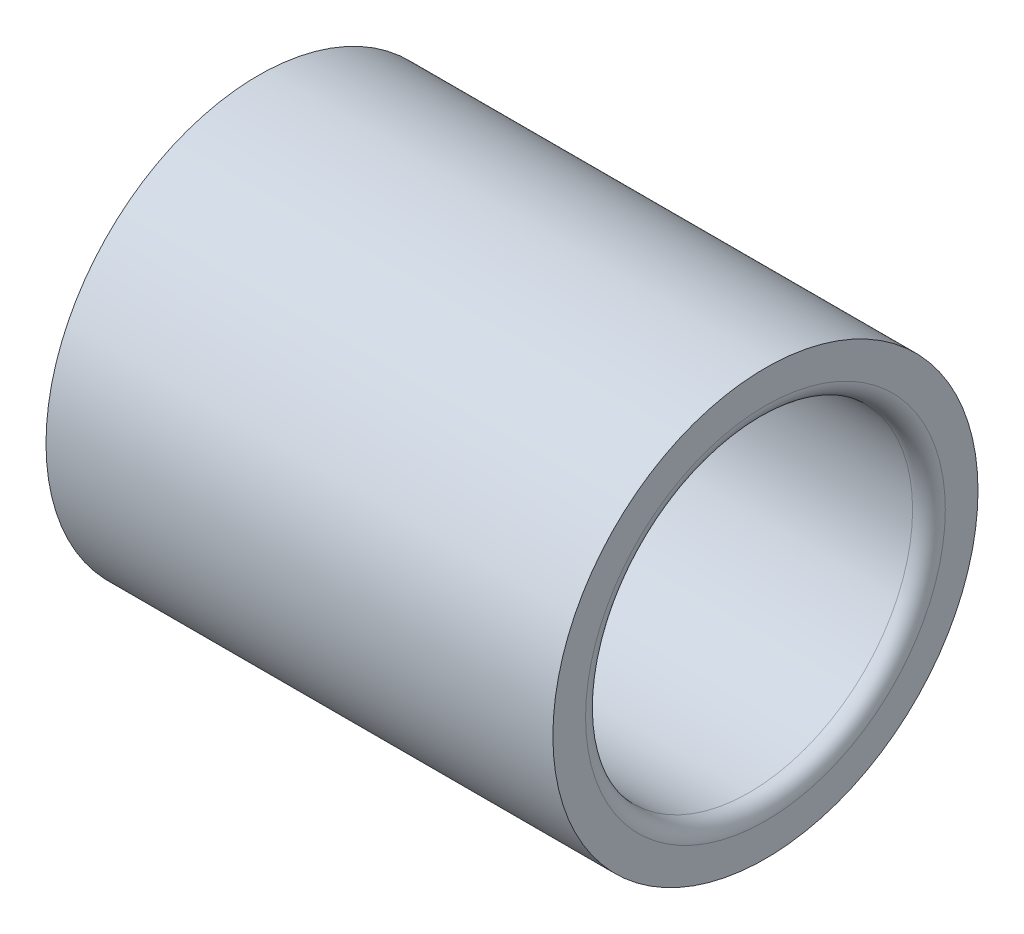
ISO-10303-21;
HEADER;
FILE_DESCRIPTION(('STEP AP214'),'2;1');
FILE_NAME('part.step','',(''),(''),'','','');
FILE_SCHEMA(('AUTOMOTIVE_DESIGN { 1 0 10303 214 1 1 1 1 }'));
ENDSEC;
DATA;
#1=APPLICATION_CONTEXT('core data for automotive mechanical design processes');
#2=APPLICATION_PROTOCOL_DEFINITION('international standard','automotive_design',2000,#1);
#3=PRODUCT_CONTEXT('',#1,'mechanical');
#4=PRODUCT('Part','Part','',(#3));
#5=PRODUCT_RELATED_PRODUCT_CATEGORY('part','',(#4));
#6=PRODUCT_DEFINITION_FORMATION('','',#4);
#7=PRODUCT_DEFINITION_CONTEXT('part definition',#1,'design');
#8=PRODUCT_DEFINITION('design','',#6,#7);
#9=PRODUCT_DEFINITION_SHAPE('','',#8);
#10=(LENGTH_UNIT() NAMED_UNIT(*) SI_UNIT(.MILLI.,.METRE.));
#11=(NAMED_UNIT(*) PLANE_ANGLE_UNIT() SI_UNIT($,.RADIAN.));
#12=(NAMED_UNIT(*) SI_UNIT($,.STERADIAN.) SOLID_ANGLE_UNIT());
#13=UNCERTAINTY_MEASURE_WITH_UNIT(LENGTH_MEASURE(1.E-05),#10,'distance_accuracy_value','');
#14=(GEOMETRIC_REPRESENTATION_CONTEXT(3) GLOBAL_UNCERTAINTY_ASSIGNED_CONTEXT((#13)) GLOBAL_UNIT_ASSIGNED_CONTEXT((#10,
#11,#12)) REPRESENTATION_CONTEXT('',''));
#15=CARTESIAN_POINT('',(0.,0.,0.));
#16=DIRECTION('',(0.,0.,1.));
#17=DIRECTION('',(1.,0.,0.));
#18=AXIS2_PLACEMENT_3D('',#15,#16,#17);
#19=CARTESIAN_POINT('',(0.,11.,0.));
#20=DIRECTION('',(-1.,0.,0.));
#21=DIRECTION('',(0.,0.,1.));
#22=AXIS2_PLACEMENT_3D('',#19,#20,#21);
#23=PLANE('',#22);
#24=CARTESIAN_POINT('',(0.,0.,0.));
#25=DIRECTION('',(-1.,0.,0.));
#26=DIRECTION('',(0.,0.,1.));
#27=AXIS2_PLACEMENT_3D('',#24,#25,#26);
#28=CIRCLE('',#27,13.);
#29=CARTESIAN_POINT('',(0.,0.,13.));
#30=VERTEX_POINT('',#29);
#31=EDGE_CURVE('E10',#30,#30,#28,.T.);
#32=ORIENTED_EDGE('',*,*,#31,.T.);
#33=EDGE_LOOP('',(#32));
#34=FACE_BOUND('',#33,.T.);
#35=CARTESIAN_POINT('',(0.,0.,0.));
#36=DIRECTION('',(-1.,0.,0.));
#37=DIRECTION('',(0.,0.,1.));
#38=AXIS2_PLACEMENT_3D('',#35,#36,#37);
#39=CIRCLE('',#38,11.);
#40=CARTESIAN_POINT('',(0.,0.,11.));
#41=VERTEX_POINT('',#40);
#42=EDGE_CURVE('E37',#41,#41,#39,.T.);
#43=ORIENTED_EDGE('',*,*,#42,.F.);
#44=EDGE_LOOP('',(#43));
#45=FACE_BOUND('',#44,.T.);
#46=ADVANCED_FACE('F15',(#34,#45),#23,.T.);
#47=CARTESIAN_POINT('',(0.,0.,0.));
#48=DIRECTION('',(-1.,0.,0.));
#49=DIRECTION('',(0.,0.,1.));
#50=AXIS2_PLACEMENT_3D('',#47,#48,#49);
#51=CYLINDRICAL_SURFACE('',#50,13.);
#52=CARTESIAN_POINT('',(31.,0.,0.));
#53=DIRECTION('',(-1.,0.,0.));
#54=DIRECTION('',(0.,0.,1.));
#55=AXIS2_PLACEMENT_3D('',#52,#53,#54);
#56=CIRCLE('',#55,13.);
#57=CARTESIAN_POINT('',(31.,0.,13.));
#58=VERTEX_POINT('',#57);
#59=EDGE_CURVE('E21',#58,#58,#56,.T.);
#60=ORIENTED_EDGE('',*,*,#59,.T.);
#61=EDGE_LOOP('',(#60));
#62=FACE_BOUND('',#61,.T.);
#63=ORIENTED_EDGE('',*,*,#31,.F.);
#64=EDGE_LOOP('',(#63));
#65=FACE_BOUND('',#64,.T.);
#66=ADVANCED_FACE('F45',(#62,#65),#51,.T.);
#67=CARTESIAN_POINT('',(31.,13.,0.));
#68=DIRECTION('',(1.,0.,0.));
#69=DIRECTION('',(0.,0.,-1.));
#70=AXIS2_PLACEMENT_3D('',#67,#68,#69);
#71=PLANE('',#70);
#72=CARTESIAN_POINT('',(31.,0.,0.));
#73=DIRECTION('',(-1.,0.,0.));
#74=DIRECTION('',(0.,0.,1.));
#75=AXIS2_PLACEMENT_3D('',#72,#73,#74);
#76=CIRCLE('',#75,11.);
#77=CARTESIAN_POINT('',(31.,0.,11.));
#78=VERTEX_POINT('',#77);
#79=EDGE_CURVE('E25',#78,#78,#76,.T.);
#80=ORIENTED_EDGE('',*,*,#79,.T.);
#81=EDGE_LOOP('',(#80));
#82=FACE_BOUND('',#81,.T.);
#83=ORIENTED_EDGE('',*,*,#59,.F.);
#84=EDGE_LOOP('',(#83));
#85=FACE_BOUND('',#84,.T.);
#86=ADVANCED_FACE('F52',(#82,#85),#71,.T.);
#87=CARTESIAN_POINT('',(30.,0.,0.));
#88=DIRECTION('',(-1.,0.,0.));
#89=DIRECTION('',(0.,0.,1.));
#90=AXIS2_PLACEMENT_3D('',#87,#88,#89);
#91=TOROIDAL_SURFACE('',#90,11.,1.);
#92=ORIENTED_EDGE('',*,*,#79,.F.);
#93=EDGE_LOOP('',(#92));
#94=FACE_BOUND('',#93,.T.);
#95=CARTESIAN_POINT('',(30.,0.,0.));
#96=DIRECTION('',(-1.,0.,0.));
#97=DIRECTION('',(0.,0.,1.));
#98=AXIS2_PLACEMENT_3D('',#95,#96,#97);
#99=CIRCLE('',#98,10.);
#100=CARTESIAN_POINT('',(30.,0.,10.));
#101=VERTEX_POINT('',#100);
#102=EDGE_CURVE('E29',#101,#101,#99,.T.);
#103=ORIENTED_EDGE('',*,*,#102,.T.);
#104=EDGE_LOOP('',(#103));
#105=FACE_BOUND('',#104,.T.);
#106=ADVANCED_FACE('F57',(#94,#105),#91,.T.);
#107=CARTESIAN_POINT('',(0.,0.,0.));
#108=DIRECTION('',(-1.,0.,0.));
#109=DIRECTION('',(0.,0.,1.));
#110=AXIS2_PLACEMENT_3D('',#107,#108,#109);
#111=CYLINDRICAL_SURFACE('',#110,10.);
#112=CARTESIAN_POINT('',(1.,0.,0.));
#113=DIRECTION('',(-1.,0.,0.));
#114=DIRECTION('',(0.,0.,1.));
#115=AXIS2_PLACEMENT_3D('',#112,#113,#114);
#116=CIRCLE('',#115,10.);
#117=CARTESIAN_POINT('',(1.,0.,10.));
#118=VERTEX_POINT('',#117);
#119=EDGE_CURVE('E34',#118,#118,#116,.T.);
#120=ORIENTED_EDGE('',*,*,#119,.T.);
#121=EDGE_LOOP('',(#120));
#122=FACE_BOUND('',#121,.T.);
#123=ORIENTED_EDGE('',*,*,#102,.F.);
#124=EDGE_LOOP('',(#123));
#125=FACE_BOUND('',#124,.T.);
#126=ADVANCED_FACE('F64',(#122,#125),#111,.F.);
#127=CARTESIAN_POINT('',(1.,0.,0.));
#128=DIRECTION('',(-1.,0.,0.));
#129=DIRECTION('',(0.,0.,1.));
#130=AXIS2_PLACEMENT_3D('',#127,#128,#129);
#131=CONICAL_SURFACE('',#130,10.,0.785398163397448);
#132=ORIENTED_EDGE('',*,*,#42,.T.);
#133=EDGE_LOOP('',(#132));
#134=FACE_BOUND('',#133,.T.);
#135=ORIENTED_EDGE('',*,*,#119,.F.);
#136=EDGE_LOOP('',(#135));
#137=FACE_BOUND('',#136,.T.);
#138=ADVANCED_FACE('F41',(#134,#137),#131,.F.);
#139=CLOSED_SHELL('',(#46,#66,#86,#106,#126,#138));
#140=MANIFOLD_SOLID_BREP('B1',#139);
#141=ADVANCED_BREP_SHAPE_REPRESENTATION('',(#18,#140),#14);
#142=SHAPE_DEFINITION_REPRESENTATION(#9,#141);
ENDSEC;
END-ISO-10303-21;
